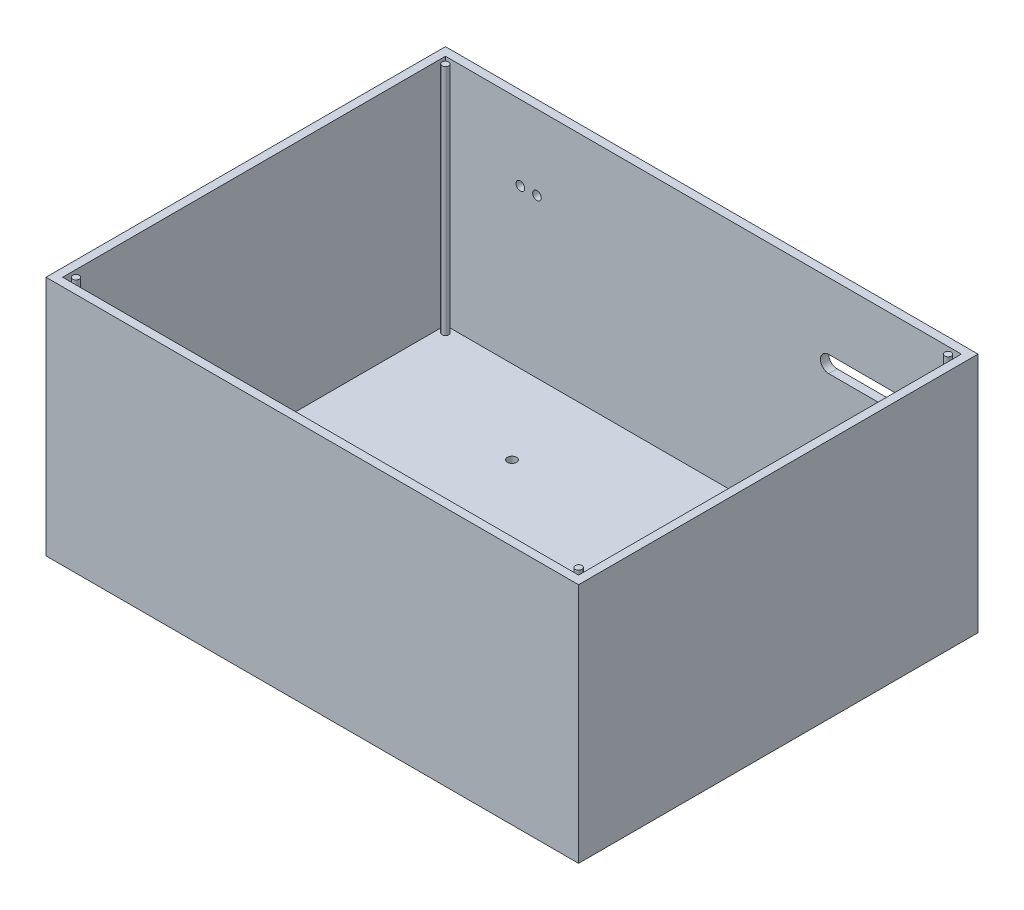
ISO-10303-21;
HEADER;
FILE_DESCRIPTION(('STEP AP214'),'2;1');
FILE_NAME('part.step','',(''),(''),'','','');
FILE_SCHEMA(('AUTOMOTIVE_DESIGN { 1 0 10303 214 1 1 1 1 }'));
ENDSEC;
DATA;
#1=APPLICATION_CONTEXT('core data for automotive mechanical design processes');
#2=APPLICATION_PROTOCOL_DEFINITION('international standard','automotive_design',2000,#1);
#3=PRODUCT_CONTEXT('',#1,'mechanical');
#4=PRODUCT('Part','Part','',(#3));
#5=PRODUCT_RELATED_PRODUCT_CATEGORY('part','',(#4));
#6=PRODUCT_DEFINITION_FORMATION('','',#4);
#7=PRODUCT_DEFINITION_CONTEXT('part definition',#1,'design');
#8=PRODUCT_DEFINITION('design','',#6,#7);
#9=PRODUCT_DEFINITION_SHAPE('','',#8);
#10=(LENGTH_UNIT() NAMED_UNIT(*) SI_UNIT(.MILLI.,.METRE.));
#11=(NAMED_UNIT(*) PLANE_ANGLE_UNIT() SI_UNIT($,.RADIAN.));
#12=(NAMED_UNIT(*) SI_UNIT($,.STERADIAN.) SOLID_ANGLE_UNIT());
#13=UNCERTAINTY_MEASURE_WITH_UNIT(LENGTH_MEASURE(1.E-05),#10,'distance_accuracy_value','');
#14=(GEOMETRIC_REPRESENTATION_CONTEXT(3) GLOBAL_UNCERTAINTY_ASSIGNED_CONTEXT((#13)) GLOBAL_UNIT_ASSIGNED_CONTEXT((#10,
#11,#12)) REPRESENTATION_CONTEXT('',''));
#15=CARTESIAN_POINT('',(0.,0.,0.));
#16=DIRECTION('',(0.,0.,1.));
#17=DIRECTION('',(1.,0.,0.));
#18=AXIS2_PLACEMENT_3D('',#15,#16,#17);
#19=CARTESIAN_POINT('',(0.,3.175,0.));
#20=DIRECTION('',(1.,0.,0.));
#21=DIRECTION('',(0.,0.,-1.));
#22=AXIS2_PLACEMENT_3D('',#19,#20,#21);
#23=PLANE('',#22);
#24=DIRECTION('',(0.,0.,1.));
#25=VECTOR('',#24,1.);
#26=CARTESIAN_POINT('',(0.,0.,0.));
#27=LINE('',#26,#25);
#28=CARTESIAN_POINT('',(0.,0.,-152.4));
#29=VERTEX_POINT('',#28);
#30=CARTESIAN_POINT('',(0.,0.,0.));
#31=VERTEX_POINT('',#30);
#32=EDGE_CURVE('E250',#29,#31,#27,.T.);
#33=ORIENTED_EDGE('',*,*,#32,.T.);
#34=DIRECTION('',(0.,-1.,0.));
#35=VECTOR('',#34,1.);
#36=CARTESIAN_POINT('',(0.,3.175,0.));
#37=LINE('',#36,#35);
#38=CARTESIAN_POINT('',(0.,92.075,0.));
#39=VERTEX_POINT('',#38);
#40=EDGE_CURVE('E268',#39,#31,#37,.T.);
#41=ORIENTED_EDGE('',*,*,#40,.F.);
#42=DIRECTION('',(0.,0.,1.));
#43=VECTOR('',#42,1.);
#44=CARTESIAN_POINT('',(0.,92.075,-152.4));
#45=LINE('',#44,#43);
#46=CARTESIAN_POINT('',(0.,92.075,-152.4));
#47=VERTEX_POINT('',#46);
#48=EDGE_CURVE('E244',#47,#39,#45,.T.);
#49=ORIENTED_EDGE('',*,*,#48,.F.);
#50=DIRECTION('',(0.,-1.,0.));
#51=VECTOR('',#50,1.);
#52=CARTESIAN_POINT('',(0.,3.175,-152.4));
#53=LINE('',#52,#51);
#54=EDGE_CURVE('E259',#47,#29,#53,.T.);
#55=ORIENTED_EDGE('',*,*,#54,.T.);
#56=EDGE_LOOP('',(#33,#41,#49,#55));
#57=FACE_BOUND('',#56,.T.);
#58=ADVANCED_FACE('F56',(#57),#23,.F.);
#59=CARTESIAN_POINT('',(0.,3.175,0.));
#60=DIRECTION('',(0.,0.,-1.));
#61=DIRECTION('',(-1.,0.,0.));
#62=AXIS2_PLACEMENT_3D('',#59,#60,#61);
#63=PLANE('',#62);
#64=DIRECTION('',(1.,0.,0.));
#65=VECTOR('',#64,1.);
#66=CARTESIAN_POINT('',(0.,0.,0.));
#67=LINE('',#66,#65);
#68=CARTESIAN_POINT('',(203.2,0.,0.));
#69=VERTEX_POINT('',#68);
#70=EDGE_CURVE('E253',#31,#69,#67,.T.);
#71=ORIENTED_EDGE('',*,*,#70,.T.);
#72=DIRECTION('',(0.,-1.,0.));
#73=VECTOR('',#72,1.);
#74=CARTESIAN_POINT('',(203.2,3.175,0.));
#75=LINE('',#74,#73);
#76=CARTESIAN_POINT('',(203.2,92.075,0.));
#77=VERTEX_POINT('',#76);
#78=EDGE_CURVE('E265',#77,#69,#75,.T.);
#79=ORIENTED_EDGE('',*,*,#78,.F.);
#80=DIRECTION('',(1.,0.,0.));
#81=VECTOR('',#80,1.);
#82=CARTESIAN_POINT('',(0.,92.075,0.));
#83=LINE('',#82,#81);
#84=EDGE_CURVE('E247',#39,#77,#83,.T.);
#85=ORIENTED_EDGE('',*,*,#84,.F.);
#86=ORIENTED_EDGE('',*,*,#40,.T.);
#87=EDGE_LOOP('',(#71,#79,#85,#86));
#88=FACE_BOUND('',#87,.T.);
#89=ADVANCED_FACE('F338',(#88),#63,.F.);
#90=CARTESIAN_POINT('',(203.2,3.175,0.));
#91=DIRECTION('',(-1.,0.,0.));
#92=DIRECTION('',(0.,0.,1.));
#93=AXIS2_PLACEMENT_3D('',#90,#91,#92);
#94=PLANE('',#93);
#95=DIRECTION('',(0.,0.,-1.));
#96=VECTOR('',#95,1.);
#97=CARTESIAN_POINT('',(203.2,0.,0.));
#98=LINE('',#97,#96);
#99=CARTESIAN_POINT('',(203.2,0.,-152.4));
#100=VERTEX_POINT('',#99);
#101=EDGE_CURVE('E255',#69,#100,#98,.T.);
#102=ORIENTED_EDGE('',*,*,#101,.T.);
#103=DIRECTION('',(0.,-1.,0.));
#104=VECTOR('',#103,1.);
#105=CARTESIAN_POINT('',(203.2,3.175,-152.4));
#106=LINE('',#105,#104);
#107=CARTESIAN_POINT('',(203.2,92.075,-152.4));
#108=VERTEX_POINT('',#107);
#109=EDGE_CURVE('E262',#108,#100,#106,.T.);
#110=ORIENTED_EDGE('',*,*,#109,.F.);
#111=DIRECTION('',(0.,0.,-1.));
#112=VECTOR('',#111,1.);
#113=CARTESIAN_POINT('',(203.2,92.075,0.));
#114=LINE('',#113,#112);
#115=EDGE_CURVE('E238',#77,#108,#114,.T.);
#116=ORIENTED_EDGE('',*,*,#115,.F.);
#117=ORIENTED_EDGE('',*,*,#78,.T.);
#118=EDGE_LOOP('',(#102,#110,#116,#117));
#119=FACE_BOUND('',#118,.T.);
#120=ADVANCED_FACE('F343',(#119),#94,.F.);
#121=CARTESIAN_POINT('',(0.,3.175,-152.4));
#122=DIRECTION('',(0.,0.,1.));
#123=DIRECTION('',(1.,0.,0.));
#124=AXIS2_PLACEMENT_3D('',#121,#122,#123);
#125=PLANE('',#124);
#126=CARTESIAN_POINT('',(149.422369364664,63.5,-152.4));
#127=DIRECTION('',(0.,0.,-1.));
#128=DIRECTION('',(-1.,0.,0.));
#129=AXIS2_PLACEMENT_3D('',#126,#127,#128);
#130=CIRCLE('',#129,3.17499999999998);
#131=CARTESIAN_POINT('',(149.422369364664,60.325,-152.4));
#132=VERTEX_POINT('',#131);
#133=CARTESIAN_POINT('',(149.422369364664,66.675,-152.4));
#134=VERTEX_POINT('',#133);
#135=EDGE_CURVE('E159',#132,#134,#130,.T.);
#136=ORIENTED_EDGE('',*,*,#135,.F.);
#137=DIRECTION('',(-1.,0.,0.));
#138=VECTOR('',#137,1.);
#139=CARTESIAN_POINT('',(174.625,60.325,-152.4));
#140=LINE('',#139,#138);
#141=CARTESIAN_POINT('',(174.625,60.325,-152.4));
#142=VERTEX_POINT('',#141);
#143=EDGE_CURVE('E178',#142,#132,#140,.T.);
#144=ORIENTED_EDGE('',*,*,#143,.F.);
#145=CARTESIAN_POINT('',(174.625,63.5,-152.4));
#146=DIRECTION('',(0.,0.,-1.));
#147=DIRECTION('',(-1.,0.,0.));
#148=AXIS2_PLACEMENT_3D('',#145,#146,#147);
#149=CIRCLE('',#148,3.17499999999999);
#150=CARTESIAN_POINT('',(174.625,66.675,-152.4));
#151=VERTEX_POINT('',#150);
#152=EDGE_CURVE('E176',#151,#142,#149,.T.);
#153=ORIENTED_EDGE('',*,*,#152,.F.);
#154=DIRECTION('',(1.,0.,0.));
#155=VECTOR('',#154,1.);
#156=CARTESIAN_POINT('',(174.625,66.675,-152.4));
#157=LINE('',#156,#155);
#158=EDGE_CURVE('E70',#134,#151,#157,.T.);
#159=ORIENTED_EDGE('',*,*,#158,.F.);
#160=EDGE_LOOP('',(#136,#144,#153,#159));
#161=FACE_BOUND('',#160,.T.);
#162=CARTESIAN_POINT('',(31.75,63.5,-152.4));
#163=DIRECTION('',(0.,0.,-1.));
#164=DIRECTION('',(-1.,0.,0.));
#165=AXIS2_PLACEMENT_3D('',#162,#163,#164);
#166=CIRCLE('',#165,1.651);
#167=CARTESIAN_POINT('',(30.099,63.5,-152.4));
#168=VERTEX_POINT('',#167);
#169=EDGE_CURVE('E194',#168,#168,#166,.T.);
#170=ORIENTED_EDGE('',*,*,#169,.F.);
#171=EDGE_LOOP('',(#170));
#172=FACE_BOUND('',#171,.T.);
#173=CARTESIAN_POINT('',(38.1,63.5,-152.4));
#174=DIRECTION('',(0.,0.,-1.));
#175=DIRECTION('',(-1.,0.,0.));
#176=AXIS2_PLACEMENT_3D('',#173,#174,#175);
#177=CIRCLE('',#176,1.651);
#178=CARTESIAN_POINT('',(36.449,63.5,-152.4));
#179=VERTEX_POINT('',#178);
#180=EDGE_CURVE('E187',#179,#179,#177,.T.);
#181=ORIENTED_EDGE('',*,*,#180,.F.);
#182=EDGE_LOOP('',(#181));
#183=FACE_BOUND('',#182,.T.);
#184=DIRECTION('',(-1.,0.,0.));
#185=VECTOR('',#184,1.);
#186=CARTESIAN_POINT('',(0.,0.,-152.4));
#187=LINE('',#186,#185);
#188=EDGE_CURVE('E257',#100,#29,#187,.T.);
#189=ORIENTED_EDGE('',*,*,#188,.T.);
#190=ORIENTED_EDGE('',*,*,#54,.F.);
#191=DIRECTION('',(-1.,0.,0.));
#192=VECTOR('',#191,1.);
#193=CARTESIAN_POINT('',(203.2,92.075,-152.4));
#194=LINE('',#193,#192);
#195=EDGE_CURVE('E241',#108,#47,#194,.T.);
#196=ORIENTED_EDGE('',*,*,#195,.F.);
#197=ORIENTED_EDGE('',*,*,#109,.T.);
#198=EDGE_LOOP('',(#189,#190,#196,#197));
#199=FACE_BOUND('',#198,.T.);
#200=ADVANCED_FACE('F357',(#161,#172,#183,#199),#125,.F.);
#201=CARTESIAN_POINT('',(0.,0.,0.));
#202=DIRECTION('',(0.,-1.,0.));
#203=DIRECTION('',(0.,0.,-1.));
#204=AXIS2_PLACEMENT_3D('',#201,#202,#203);
#205=PLANE('',#204);
#206=CARTESIAN_POINT('',(123.825,0.,-117.475));
#207=DIRECTION('',(0.,1.,0.));
#208=DIRECTION('',(0.,0.,1.));
#209=AXIS2_PLACEMENT_3D('',#206,#207,#208);
#210=CIRCLE('',#209,1.71449999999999);
#211=CARTESIAN_POINT('',(123.825,0.,-115.7605));
#212=VERTEX_POINT('',#211);
#213=EDGE_CURVE('E198',#212,#212,#210,.T.);
#214=ORIENTED_EDGE('',*,*,#213,.T.);
#215=EDGE_LOOP('',(#214));
#216=FACE_BOUND('',#215,.T.);
#217=CARTESIAN_POINT('',(60.325,0.,-47.625));
#218=DIRECTION('',(0.,1.,0.));
#219=DIRECTION('',(0.,0.,1.));
#220=AXIS2_PLACEMENT_3D('',#217,#218,#219);
#221=CIRCLE('',#220,1.7145);
#222=CARTESIAN_POINT('',(60.325,0.,-45.9105));
#223=VERTEX_POINT('',#222);
#224=EDGE_CURVE('E197',#223,#223,#221,.T.);
#225=ORIENTED_EDGE('',*,*,#224,.T.);
#226=EDGE_LOOP('',(#225));
#227=FACE_BOUND('',#226,.T.);
#228=CARTESIAN_POINT('',(123.825,0.,-47.625));
#229=DIRECTION('',(0.,1.,0.));
#230=DIRECTION('',(0.,0.,1.));
#231=AXIS2_PLACEMENT_3D('',#228,#229,#230);
#232=CIRCLE('',#231,1.71449999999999);
#233=CARTESIAN_POINT('',(123.825,0.,-45.9105));
#234=VERTEX_POINT('',#233);
#235=EDGE_CURVE('E190',#234,#234,#232,.T.);
#236=ORIENTED_EDGE('',*,*,#235,.T.);
#237=EDGE_LOOP('',(#236));
#238=FACE_BOUND('',#237,.T.);
#239=CARTESIAN_POINT('',(60.325,0.,-117.475));
#240=DIRECTION('',(0.,1.,0.));
#241=DIRECTION('',(0.,0.,1.));
#242=AXIS2_PLACEMENT_3D('',#239,#240,#241);
#243=CIRCLE('',#242,1.7145);
#244=CARTESIAN_POINT('',(60.325,0.,-115.7605));
#245=VERTEX_POINT('',#244);
#246=EDGE_CURVE('E201',#245,#245,#243,.T.);
#247=ORIENTED_EDGE('',*,*,#246,.T.);
#248=EDGE_LOOP('',(#247));
#249=FACE_BOUND('',#248,.T.);
#250=ORIENTED_EDGE('',*,*,#32,.F.);
#251=ORIENTED_EDGE('',*,*,#188,.F.);
#252=ORIENTED_EDGE('',*,*,#101,.F.);
#253=ORIENTED_EDGE('',*,*,#70,.F.);
#254=EDGE_LOOP('',(#250,#251,#252,#253));
#255=FACE_BOUND('',#254,.T.);
#256=ADVANCED_FACE('F349',(#216,#227,#238,#249,#255),#205,.T.);
#257=CARTESIAN_POINT('',(0.,92.075,0.));
#258=DIRECTION('',(0.,1.,0.));
#259=DIRECTION('',(0.,0.,1.));
#260=AXIS2_PLACEMENT_3D('',#257,#258,#259);
#261=PLANE('',#260);
#262=ORIENTED_EDGE('',*,*,#115,.T.);
#263=ORIENTED_EDGE('',*,*,#195,.T.);
#264=ORIENTED_EDGE('',*,*,#48,.T.);
#265=ORIENTED_EDGE('',*,*,#84,.T.);
#266=EDGE_LOOP('',(#262,#263,#264,#265));
#267=FACE_BOUND('',#266,.T.);
#268=DIRECTION('',(1.,0.,0.));
#269=VECTOR('',#268,1.);
#270=CARTESIAN_POINT('',(3.175,92.075,-3.175));
#271=LINE('',#270,#269);
#272=CARTESIAN_POINT('',(3.175,92.075,-3.175));
#273=VERTEX_POINT('',#272);
#274=CARTESIAN_POINT('',(200.025,92.075,-3.175));
#275=VERTEX_POINT('',#274);
#276=EDGE_CURVE('E209',#273,#275,#271,.T.);
#277=ORIENTED_EDGE('',*,*,#276,.F.);
#278=DIRECTION('',(0.,0.,1.));
#279=VECTOR('',#278,1.);
#280=CARTESIAN_POINT('',(3.175,92.075,-149.225));
#281=LINE('',#280,#279);
#282=CARTESIAN_POINT('',(3.175,92.075,-149.225));
#283=VERTEX_POINT('',#282);
#284=EDGE_CURVE('E207',#283,#273,#281,.T.);
#285=ORIENTED_EDGE('',*,*,#284,.F.);
#286=DIRECTION('',(-1.,0.,0.));
#287=VECTOR('',#286,1.);
#288=CARTESIAN_POINT('',(200.025,92.075,-149.225));
#289=LINE('',#288,#287);
#290=CARTESIAN_POINT('',(200.025,92.075,-149.225));
#291=VERTEX_POINT('',#290);
#292=EDGE_CURVE('E215',#291,#283,#289,.T.);
#293=ORIENTED_EDGE('',*,*,#292,.F.);
#294=DIRECTION('',(0.,0.,-1.));
#295=VECTOR('',#294,1.);
#296=CARTESIAN_POINT('',(200.025,92.075,-3.175));
#297=LINE('',#296,#295);
#298=EDGE_CURVE('E212',#275,#291,#297,.T.);
#299=ORIENTED_EDGE('',*,*,#298,.F.);
#300=EDGE_LOOP('',(#277,#285,#293,#299));
#301=FACE_BOUND('',#300,.T.);
#302=ADVANCED_FACE('F326',(#267,#301),#261,.T.);
#303=CARTESIAN_POINT('',(3.175,92.075,-149.225));
#304=DIRECTION('',(1.,0.,0.));
#305=DIRECTION('',(0.,0.,-1.));
#306=AXIS2_PLACEMENT_3D('',#303,#304,#305);
#307=PLANE('',#306);
#308=DIRECTION('',(0.,0.,1.));
#309=VECTOR('',#308,1.);
#310=CARTESIAN_POINT('',(3.175,3.175,-149.225));
#311=LINE('',#310,#309);
#312=CARTESIAN_POINT('',(3.175,3.175,-149.225));
#313=VERTEX_POINT('',#312);
#314=CARTESIAN_POINT('',(3.175,3.175,-3.175));
#315=VERTEX_POINT('',#314);
#316=EDGE_CURVE('E218',#313,#315,#311,.T.);
#317=ORIENTED_EDGE('',*,*,#316,.F.);
#318=DIRECTION('',(0.,-1.,0.));
#319=VECTOR('',#318,1.);
#320=CARTESIAN_POINT('',(3.175,92.075,-149.225));
#321=LINE('',#320,#319);
#322=EDGE_CURVE('E217',#283,#313,#321,.T.);
#323=ORIENTED_EDGE('',*,*,#322,.F.);
#324=ORIENTED_EDGE('',*,*,#284,.T.);
#325=DIRECTION('',(0.,-1.,0.));
#326=VECTOR('',#325,1.);
#327=CARTESIAN_POINT('',(3.175,92.075,-3.175));
#328=LINE('',#327,#326);
#329=EDGE_CURVE('E235',#273,#315,#328,.T.);
#330=ORIENTED_EDGE('',*,*,#329,.T.);
#331=EDGE_LOOP('',(#317,#323,#324,#330));
#332=FACE_BOUND('',#331,.T.);
#333=ADVANCED_FACE('F318',(#332),#307,.T.);
#334=CARTESIAN_POINT('',(3.175,92.075,-3.175));
#335=DIRECTION('',(0.,0.,-1.));
#336=DIRECTION('',(-1.,0.,0.));
#337=AXIS2_PLACEMENT_3D('',#334,#335,#336);
#338=PLANE('',#337);
#339=DIRECTION('',(1.,0.,0.));
#340=VECTOR('',#339,1.);
#341=CARTESIAN_POINT('',(3.175,3.175,-3.175));
#342=LINE('',#341,#340);
#343=CARTESIAN_POINT('',(200.025,3.175,-3.175));
#344=VERTEX_POINT('',#343);
#345=EDGE_CURVE('E221',#315,#344,#342,.T.);
#346=ORIENTED_EDGE('',*,*,#345,.F.);
#347=ORIENTED_EDGE('',*,*,#329,.F.);
#348=ORIENTED_EDGE('',*,*,#276,.T.);
#349=DIRECTION('',(0.,-1.,0.));
#350=VECTOR('',#349,1.);
#351=CARTESIAN_POINT('',(200.025,92.075,-3.175));
#352=LINE('',#351,#350);
#353=EDGE_CURVE('E233',#275,#344,#352,.T.);
#354=ORIENTED_EDGE('',*,*,#353,.T.);
#355=EDGE_LOOP('',(#346,#347,#348,#354));
#356=FACE_BOUND('',#355,.T.);
#357=ADVANCED_FACE('F322',(#356),#338,.T.);
#358=CARTESIAN_POINT('',(200.025,92.075,-3.175));
#359=DIRECTION('',(-1.,0.,0.));
#360=DIRECTION('',(0.,0.,1.));
#361=AXIS2_PLACEMENT_3D('',#358,#359,#360);
#362=PLANE('',#361);
#363=DIRECTION('',(0.,0.,-1.));
#364=VECTOR('',#363,1.);
#365=CARTESIAN_POINT('',(200.025,3.175,-3.175));
#366=LINE('',#365,#364);
#367=CARTESIAN_POINT('',(200.025,3.175,-149.225));
#368=VERTEX_POINT('',#367);
#369=EDGE_CURVE('E225',#344,#368,#366,.T.);
#370=ORIENTED_EDGE('',*,*,#369,.F.);
#371=ORIENTED_EDGE('',*,*,#353,.F.);
#372=ORIENTED_EDGE('',*,*,#298,.T.);
#373=DIRECTION('',(0.,-1.,0.));
#374=VECTOR('',#373,1.);
#375=CARTESIAN_POINT('',(200.025,92.075,-149.225));
#376=LINE('',#375,#374);
#377=EDGE_CURVE('E231',#291,#368,#376,.T.);
#378=ORIENTED_EDGE('',*,*,#377,.T.);
#379=EDGE_LOOP('',(#370,#371,#372,#378));
#380=FACE_BOUND('',#379,.T.);
#381=ADVANCED_FACE('F328',(#380),#362,.T.);
#382=CARTESIAN_POINT('',(200.025,92.075,-149.225));
#383=DIRECTION('',(0.,0.,1.));
#384=DIRECTION('',(1.,0.,0.));
#385=AXIS2_PLACEMENT_3D('',#382,#383,#384);
#386=PLANE('',#385);
#387=DIRECTION('',(-1.,0.,0.));
#388=VECTOR('',#387,1.);
#389=CARTESIAN_POINT('',(174.625,60.325,-149.225));
#390=LINE('',#389,#388);
#391=CARTESIAN_POINT('',(174.625,60.325,-149.225));
#392=VERTEX_POINT('',#391);
#393=CARTESIAN_POINT('',(149.422369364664,60.325,-149.225));
#394=VERTEX_POINT('',#393);
#395=EDGE_CURVE('E165',#392,#394,#390,.T.);
#396=ORIENTED_EDGE('',*,*,#395,.T.);
#397=CARTESIAN_POINT('',(149.422369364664,63.5,-149.225));
#398=DIRECTION('',(0.,0.,1.));
#399=DIRECTION('',(1.,0.,0.));
#400=AXIS2_PLACEMENT_3D('',#397,#398,#399);
#401=CIRCLE('',#400,3.17499999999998);
#402=CARTESIAN_POINT('',(149.422369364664,66.675,-149.225));
#403=VERTEX_POINT('',#402);
#404=EDGE_CURVE('E153',#394,#403,#401,.F.);
#405=ORIENTED_EDGE('',*,*,#404,.T.);
#406=DIRECTION('',(1.,0.,0.));
#407=VECTOR('',#406,1.);
#408=CARTESIAN_POINT('',(174.625,66.675,-149.225));
#409=LINE('',#408,#407);
#410=CARTESIAN_POINT('',(174.625,66.675,-149.225));
#411=VERTEX_POINT('',#410);
#412=EDGE_CURVE('E143',#403,#411,#409,.T.);
#413=ORIENTED_EDGE('',*,*,#412,.T.);
#414=CARTESIAN_POINT('',(174.625,63.5,-149.225));
#415=DIRECTION('',(0.,0.,1.));
#416=DIRECTION('',(1.,0.,0.));
#417=AXIS2_PLACEMENT_3D('',#414,#415,#416);
#418=CIRCLE('',#417,3.17499999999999);
#419=EDGE_CURVE('E152',#411,#392,#418,.F.);
#420=ORIENTED_EDGE('',*,*,#419,.T.);
#421=EDGE_LOOP('',(#396,#405,#413,#420));
#422=FACE_BOUND('',#421,.T.);
#423=CARTESIAN_POINT('',(31.75,63.5,-149.225));
#424=DIRECTION('',(0.,0.,1.));
#425=DIRECTION('',(1.,0.,0.));
#426=AXIS2_PLACEMENT_3D('',#423,#424,#425);
#427=CIRCLE('',#426,1.651);
#428=CARTESIAN_POINT('',(33.401,63.5,-149.225));
#429=VERTEX_POINT('',#428);
#430=EDGE_CURVE('E172',#429,#429,#427,.F.);
#431=ORIENTED_EDGE('',*,*,#430,.T.);
#432=EDGE_LOOP('',(#431));
#433=FACE_BOUND('',#432,.T.);
#434=CARTESIAN_POINT('',(38.1,63.5,-149.225));
#435=DIRECTION('',(0.,0.,1.));
#436=DIRECTION('',(1.,0.,0.));
#437=AXIS2_PLACEMENT_3D('',#434,#435,#436);
#438=CIRCLE('',#437,1.651);
#439=CARTESIAN_POINT('',(39.751,63.5,-149.225));
#440=VERTEX_POINT('',#439);
#441=EDGE_CURVE('E191',#440,#440,#438,.F.);
#442=ORIENTED_EDGE('',*,*,#441,.T.);
#443=EDGE_LOOP('',(#442));
#444=FACE_BOUND('',#443,.T.);
#445=DIRECTION('',(-1.,0.,0.));
#446=VECTOR('',#445,1.);
#447=CARTESIAN_POINT('',(200.025,3.175,-149.225));
#448=LINE('',#447,#446);
#449=EDGE_CURVE('E210',#368,#313,#448,.T.);
#450=ORIENTED_EDGE('',*,*,#449,.F.);
#451=ORIENTED_EDGE('',*,*,#377,.F.);
#452=ORIENTED_EDGE('',*,*,#292,.T.);
#453=ORIENTED_EDGE('',*,*,#322,.T.);
#454=EDGE_LOOP('',(#450,#451,#452,#453));
#455=FACE_BOUND('',#454,.T.);
#456=ADVANCED_FACE('F163',(#422,#433,#444,#455),#386,.T.);
#457=CARTESIAN_POINT('',(0.,3.175,0.));
#458=DIRECTION('',(0.,-1.,0.));
#459=DIRECTION('',(0.,0.,-1.));
#460=AXIS2_PLACEMENT_3D('',#457,#458,#459);
#461=PLANE('',#460);
#462=CARTESIAN_POINT('',(197.485,3.175,-146.685));
#463=DIRECTION('',(0.,-1.,0.));
#464=DIRECTION('',(0.,0.,-1.));
#465=AXIS2_PLACEMENT_3D('',#462,#463,#464);
#466=CIRCLE('',#465,1.27000000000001);
#467=CARTESIAN_POINT('',(197.485,3.175,-147.955));
#468=VERTEX_POINT('',#467);
#469=EDGE_CURVE('E12',#468,#468,#466,.F.);
#470=ORIENTED_EDGE('',*,*,#469,.F.);
#471=EDGE_LOOP('',(#470));
#472=FACE_BOUND('',#471,.T.);
#473=CARTESIAN_POINT('',(197.485,3.175,-5.715));
#474=DIRECTION('',(0.,-1.,0.));
#475=DIRECTION('',(0.,0.,-1.));
#476=AXIS2_PLACEMENT_3D('',#473,#474,#475);
#477=CIRCLE('',#476,1.27);
#478=CARTESIAN_POINT('',(197.485,3.175,-6.985));
#479=VERTEX_POINT('',#478);
#480=EDGE_CURVE('E63',#479,#479,#477,.F.);
#481=ORIENTED_EDGE('',*,*,#480,.F.);
#482=EDGE_LOOP('',(#481));
#483=FACE_BOUND('',#482,.T.);
#484=CARTESIAN_POINT('',(5.715,3.175,-146.685));
#485=DIRECTION('',(0.,-1.,0.));
#486=DIRECTION('',(0.,0.,-1.));
#487=AXIS2_PLACEMENT_3D('',#484,#485,#486);
#488=CIRCLE('',#487,1.27);
#489=CARTESIAN_POINT('',(5.715,3.175,-147.955));
#490=VERTEX_POINT('',#489);
#491=EDGE_CURVE('E284',#490,#490,#488,.F.);
#492=ORIENTED_EDGE('',*,*,#491,.F.);
#493=EDGE_LOOP('',(#492));
#494=FACE_BOUND('',#493,.T.);
#495=CARTESIAN_POINT('',(5.715,3.175,-5.715));
#496=DIRECTION('',(0.,-1.,0.));
#497=DIRECTION('',(0.,0.,-1.));
#498=AXIS2_PLACEMENT_3D('',#495,#496,#497);
#499=CIRCLE('',#498,1.27);
#500=CARTESIAN_POINT('',(5.715,3.175,-6.985));
#501=VERTEX_POINT('',#500);
#502=EDGE_CURVE('E271',#501,#501,#499,.F.);
#503=ORIENTED_EDGE('',*,*,#502,.F.);
#504=EDGE_LOOP('',(#503));
#505=FACE_BOUND('',#504,.T.);
#506=CARTESIAN_POINT('',(123.825,3.175,-117.475));
#507=DIRECTION('',(0.,-1.,0.));
#508=DIRECTION('',(0.,0.,-1.));
#509=AXIS2_PLACEMENT_3D('',#506,#507,#508);
#510=CIRCLE('',#509,1.71449999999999);
#511=CARTESIAN_POINT('',(123.825,3.175,-119.1895));
#512=VERTEX_POINT('',#511);
#513=EDGE_CURVE('E222',#512,#512,#510,.T.);
#514=ORIENTED_EDGE('',*,*,#513,.T.);
#515=EDGE_LOOP('',(#514));
#516=FACE_BOUND('',#515,.T.);
#517=CARTESIAN_POINT('',(60.325,3.175,-47.625));
#518=DIRECTION('',(0.,-1.,0.));
#519=DIRECTION('',(0.,0.,-1.));
#520=AXIS2_PLACEMENT_3D('',#517,#518,#519);
#521=CIRCLE('',#520,1.7145);
#522=CARTESIAN_POINT('',(60.325,3.175,-49.3395));
#523=VERTEX_POINT('',#522);
#524=EDGE_CURVE('E277',#523,#523,#521,.T.);
#525=ORIENTED_EDGE('',*,*,#524,.T.);
#526=EDGE_LOOP('',(#525));
#527=FACE_BOUND('',#526,.T.);
#528=CARTESIAN_POINT('',(123.825,3.175,-47.625));
#529=DIRECTION('',(0.,-1.,0.));
#530=DIRECTION('',(0.,0.,-1.));
#531=AXIS2_PLACEMENT_3D('',#528,#529,#530);
#532=CIRCLE('',#531,1.71449999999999);
#533=CARTESIAN_POINT('',(123.825,3.175,-49.3395));
#534=VERTEX_POINT('',#533);
#535=EDGE_CURVE('E274',#534,#534,#532,.T.);
#536=ORIENTED_EDGE('',*,*,#535,.T.);
#537=EDGE_LOOP('',(#536));
#538=FACE_BOUND('',#537,.T.);
#539=CARTESIAN_POINT('',(60.325,3.175,-117.475));
#540=DIRECTION('',(0.,-1.,0.));
#541=DIRECTION('',(0.,0.,-1.));
#542=AXIS2_PLACEMENT_3D('',#539,#540,#541);
#543=CIRCLE('',#542,1.7145);
#544=CARTESIAN_POINT('',(60.325,3.175,-119.1895));
#545=VERTEX_POINT('',#544);
#546=EDGE_CURVE('E206',#545,#545,#543,.T.);
#547=ORIENTED_EDGE('',*,*,#546,.T.);
#548=EDGE_LOOP('',(#547));
#549=FACE_BOUND('',#548,.T.);
#550=ORIENTED_EDGE('',*,*,#449,.T.);
#551=ORIENTED_EDGE('',*,*,#316,.T.);
#552=ORIENTED_EDGE('',*,*,#345,.T.);
#553=ORIENTED_EDGE('',*,*,#369,.T.);
#554=EDGE_LOOP('',(#550,#551,#552,#553));
#555=FACE_BOUND('',#554,.T.);
#556=ADVANCED_FACE('F292',(#472,#483,#494,#505,#516,#527,#538,#549,#555),#461,.F.);
#557=CARTESIAN_POINT('',(60.325,0.,-117.475));
#558=DIRECTION('',(0.,1.,0.));
#559=DIRECTION('',(0.,0.,1.));
#560=AXIS2_PLACEMENT_3D('',#557,#558,#559);
#561=CYLINDRICAL_SURFACE('',#560,1.7145);
#562=ORIENTED_EDGE('',*,*,#246,.F.);
#563=EDGE_LOOP('',(#562));
#564=FACE_BOUND('',#563,.T.);
#565=ORIENTED_EDGE('',*,*,#546,.F.);
#566=EDGE_LOOP('',(#565));
#567=FACE_BOUND('',#566,.T.);
#568=ADVANCED_FACE('F295',(#564,#567),#561,.F.);
#569=CARTESIAN_POINT('',(123.825,0.,-47.625));
#570=DIRECTION('',(0.,1.,0.));
#571=DIRECTION('',(0.,0.,1.));
#572=AXIS2_PLACEMENT_3D('',#569,#570,#571);
#573=CYLINDRICAL_SURFACE('',#572,1.71449999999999);
#574=ORIENTED_EDGE('',*,*,#235,.F.);
#575=EDGE_LOOP('',(#574));
#576=FACE_BOUND('',#575,.T.);
#577=ORIENTED_EDGE('',*,*,#535,.F.);
#578=EDGE_LOOP('',(#577));
#579=FACE_BOUND('',#578,.T.);
#580=ADVANCED_FACE('F403',(#576,#579),#573,.F.);
#581=CARTESIAN_POINT('',(60.325,0.,-47.625));
#582=DIRECTION('',(0.,1.,0.));
#583=DIRECTION('',(0.,0.,1.));
#584=AXIS2_PLACEMENT_3D('',#581,#582,#583);
#585=CYLINDRICAL_SURFACE('',#584,1.7145);
#586=ORIENTED_EDGE('',*,*,#224,.F.);
#587=EDGE_LOOP('',(#586));
#588=FACE_BOUND('',#587,.T.);
#589=ORIENTED_EDGE('',*,*,#524,.F.);
#590=EDGE_LOOP('',(#589));
#591=FACE_BOUND('',#590,.T.);
#592=ADVANCED_FACE('F413',(#588,#591),#585,.F.);
#593=CARTESIAN_POINT('',(123.825,0.,-117.475));
#594=DIRECTION('',(0.,1.,0.));
#595=DIRECTION('',(0.,0.,1.));
#596=AXIS2_PLACEMENT_3D('',#593,#594,#595);
#597=CYLINDRICAL_SURFACE('',#596,1.71449999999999);
#598=ORIENTED_EDGE('',*,*,#213,.F.);
#599=EDGE_LOOP('',(#598));
#600=FACE_BOUND('',#599,.T.);
#601=ORIENTED_EDGE('',*,*,#513,.F.);
#602=EDGE_LOOP('',(#601));
#603=FACE_BOUND('',#602,.T.);
#604=ADVANCED_FACE('F423',(#600,#603),#597,.F.);
#605=CARTESIAN_POINT('',(38.1,63.5,0.001000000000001));
#606=DIRECTION('',(0.,0.,-1.));
#607=DIRECTION('',(-1.,0.,0.));
#608=AXIS2_PLACEMENT_3D('',#605,#606,#607);
#609=CYLINDRICAL_SURFACE('',#608,1.651);
#610=ORIENTED_EDGE('',*,*,#441,.F.);
#611=EDGE_LOOP('',(#610));
#612=FACE_BOUND('',#611,.T.);
#613=ORIENTED_EDGE('',*,*,#180,.T.);
#614=EDGE_LOOP('',(#613));
#615=FACE_BOUND('',#614,.T.);
#616=ADVANCED_FACE('F432',(#612,#615),#609,.F.);
#617=CARTESIAN_POINT('',(31.75,63.5,0.001000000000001));
#618=DIRECTION('',(0.,0.,-1.));
#619=DIRECTION('',(-1.,0.,0.));
#620=AXIS2_PLACEMENT_3D('',#617,#618,#619);
#621=CYLINDRICAL_SURFACE('',#620,1.651);
#622=ORIENTED_EDGE('',*,*,#430,.F.);
#623=EDGE_LOOP('',(#622));
#624=FACE_BOUND('',#623,.T.);
#625=ORIENTED_EDGE('',*,*,#169,.T.);
#626=EDGE_LOOP('',(#625));
#627=FACE_BOUND('',#626,.T.);
#628=ADVANCED_FACE('F455',(#624,#627),#621,.F.);
#629=CARTESIAN_POINT('',(174.625,60.325,0.001000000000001));
#630=DIRECTION('',(0.,-1.,0.));
#631=DIRECTION('',(1.,0.,0.));
#632=AXIS2_PLACEMENT_3D('',#629,#630,#631);
#633=PLANE('',#632);
#634=DIRECTION('',(0.,0.,-1.));
#635=VECTOR('',#634,1.);
#636=CARTESIAN_POINT('',(174.625,60.325,0.001000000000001));
#637=LINE('',#636,#635);
#638=EDGE_CURVE('E78',#392,#142,#637,.T.);
#639=ORIENTED_EDGE('',*,*,#638,.T.);
#640=ORIENTED_EDGE('',*,*,#143,.T.);
#641=DIRECTION('',(0.,0.,-1.));
#642=VECTOR('',#641,1.);
#643=CARTESIAN_POINT('',(149.422369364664,60.325,0.001000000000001));
#644=LINE('',#643,#642);
#645=EDGE_CURVE('E160',#394,#132,#644,.T.);
#646=ORIENTED_EDGE('',*,*,#645,.F.);
#647=ORIENTED_EDGE('',*,*,#395,.F.);
#648=EDGE_LOOP('',(#639,#640,#646,#647));
#649=FACE_BOUND('',#648,.T.);
#650=ADVANCED_FACE('F465',(#649),#633,.F.);
#651=CARTESIAN_POINT('',(149.422369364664,63.5,0.001000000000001));
#652=DIRECTION('',(0.,0.,-1.));
#653=DIRECTION('',(-1.,0.,0.));
#654=AXIS2_PLACEMENT_3D('',#651,#652,#653);
#655=CYLINDRICAL_SURFACE('',#654,3.17499999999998);
#656=ORIENTED_EDGE('',*,*,#645,.T.);
#657=ORIENTED_EDGE('',*,*,#135,.T.);
#658=DIRECTION('',(0.,0.,-1.));
#659=VECTOR('',#658,1.);
#660=CARTESIAN_POINT('',(149.422369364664,66.675,0.001000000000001));
#661=LINE('',#660,#659);
#662=EDGE_CURVE('E146',#403,#134,#661,.T.);
#663=ORIENTED_EDGE('',*,*,#662,.F.);
#664=ORIENTED_EDGE('',*,*,#404,.F.);
#665=EDGE_LOOP('',(#656,#657,#663,#664));
#666=FACE_BOUND('',#665,.T.);
#667=ADVANCED_FACE('F156',(#666),#655,.F.);
#668=CARTESIAN_POINT('',(174.625,66.675,0.001000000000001));
#669=DIRECTION('',(0.,1.,0.));
#670=DIRECTION('',(0.,0.,1.));
#671=AXIS2_PLACEMENT_3D('',#668,#669,#670);
#672=PLANE('',#671);
#673=ORIENTED_EDGE('',*,*,#662,.T.);
#674=ORIENTED_EDGE('',*,*,#158,.T.);
#675=DIRECTION('',(0.,0.,-1.));
#676=VECTOR('',#675,1.);
#677=CARTESIAN_POINT('',(174.625,66.675,0.001000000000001));
#678=LINE('',#677,#676);
#679=EDGE_CURVE('E148',#411,#151,#678,.T.);
#680=ORIENTED_EDGE('',*,*,#679,.F.);
#681=ORIENTED_EDGE('',*,*,#412,.F.);
#682=EDGE_LOOP('',(#673,#674,#680,#681));
#683=FACE_BOUND('',#682,.T.);
#684=ADVANCED_FACE('F145',(#683),#672,.F.);
#685=CARTESIAN_POINT('',(174.625,63.5,0.001000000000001));
#686=DIRECTION('',(0.,0.,-1.));
#687=DIRECTION('',(-1.,0.,0.));
#688=AXIS2_PLACEMENT_3D('',#685,#686,#687);
#689=CYLINDRICAL_SURFACE('',#688,3.17499999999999);
#690=ORIENTED_EDGE('',*,*,#679,.T.);
#691=ORIENTED_EDGE('',*,*,#152,.T.);
#692=ORIENTED_EDGE('',*,*,#638,.F.);
#693=ORIENTED_EDGE('',*,*,#419,.F.);
#694=EDGE_LOOP('',(#690,#691,#692,#693));
#695=FACE_BOUND('',#694,.T.);
#696=ADVANCED_FACE('F492',(#695),#689,.F.);
#697=CARTESIAN_POINT('',(5.715,95.6671024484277,-5.715));
#698=DIRECTION('',(0.,-1.,0.));
#699=DIRECTION('',(0.,0.,-1.));
#700=AXIS2_PLACEMENT_3D('',#697,#698,#699);
#701=CYLINDRICAL_SURFACE('',#700,1.27);
#702=CARTESIAN_POINT('',(5.715,92.075,-5.715));
#703=DIRECTION('',(0.,1.,0.));
#704=DIRECTION('',(0.,0.,1.));
#705=AXIS2_PLACEMENT_3D('',#702,#703,#704);
#706=CIRCLE('',#705,1.27);
#707=CARTESIAN_POINT('',(5.715,92.075,-6.985));
#708=VERTEX_POINT('',#707);
#709=EDGE_CURVE('E166',#708,#708,#706,.T.);
#710=CARTESIAN_POINT('',(5.715,3.175,-6.985));
#711=CARTESIAN_POINT('',(5.715,4.10104166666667,-6.985));
#712=CARTESIAN_POINT('',(5.715,5.02708333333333,-6.985));
#713=CARTESIAN_POINT('',(5.715,6.87916666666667,-6.985));
#714=CARTESIAN_POINT('',(5.715,7.80520833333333,-6.985));
#715=CARTESIAN_POINT('',(5.715,9.65729166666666,-6.985));
#716=CARTESIAN_POINT('',(5.715,10.5833333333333,-6.985));
#717=CARTESIAN_POINT('',(5.715,12.4354166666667,-6.985));
#718=CARTESIAN_POINT('',(5.715,13.3614583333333,-6.985));
#719=CARTESIAN_POINT('',(5.715,15.2135416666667,-6.985));
#720=CARTESIAN_POINT('',(5.715,16.1395833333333,-6.985));
#721=CARTESIAN_POINT('',(5.715,17.9916666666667,-6.985));
#722=CARTESIAN_POINT('',(5.715,18.9177083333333,-6.985));
#723=CARTESIAN_POINT('',(5.715,20.7697916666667,-6.985));
#724=CARTESIAN_POINT('',(5.715,21.6958333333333,-6.985));
#725=CARTESIAN_POINT('',(5.715,23.5479166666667,-6.985));
#726=CARTESIAN_POINT('',(5.715,24.4739583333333,-6.985));
#727=CARTESIAN_POINT('',(5.715,26.3260416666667,-6.985));
#728=CARTESIAN_POINT('',(5.715,27.2520833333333,-6.985));
#729=CARTESIAN_POINT('',(5.715,29.1041666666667,-6.985));
#730=CARTESIAN_POINT('',(5.715,30.0302083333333,-6.985));
#731=CARTESIAN_POINT('',(5.715,31.8822916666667,-6.985));
#732=CARTESIAN_POINT('',(5.715,32.8083333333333,-6.985));
#733=CARTESIAN_POINT('',(5.715,34.6604166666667,-6.985));
#734=CARTESIAN_POINT('',(5.715,35.5864583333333,-6.985));
#735=CARTESIAN_POINT('',(5.715,37.4385416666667,-6.985));
#736=CARTESIAN_POINT('',(5.715,38.3645833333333,-6.985));
#737=CARTESIAN_POINT('',(5.715,40.2166666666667,-6.985));
#738=CARTESIAN_POINT('',(5.715,41.1427083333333,-6.985));
#739=CARTESIAN_POINT('',(5.715,42.9947916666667,-6.985));
#740=CARTESIAN_POINT('',(5.715,43.9208333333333,-6.985));
#741=CARTESIAN_POINT('',(5.715,45.7729166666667,-6.985));
#742=CARTESIAN_POINT('',(5.715,46.6989583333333,-6.985));
#743=CARTESIAN_POINT('',(5.715,48.5510416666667,-6.985));
#744=CARTESIAN_POINT('',(5.715,49.4770833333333,-6.985));
#745=CARTESIAN_POINT('',(5.715,51.3291666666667,-6.985));
#746=CARTESIAN_POINT('',(5.715,52.2552083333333,-6.985));
#747=CARTESIAN_POINT('',(5.715,54.1072916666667,-6.985));
#748=CARTESIAN_POINT('',(5.715,55.0333333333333,-6.985));
#749=CARTESIAN_POINT('',(5.715,56.8854166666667,-6.985));
#750=CARTESIAN_POINT('',(5.715,57.8114583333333,-6.985));
#751=CARTESIAN_POINT('',(5.715,59.6635416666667,-6.985));
#752=CARTESIAN_POINT('',(5.715,60.5895833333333,-6.985));
#753=CARTESIAN_POINT('',(5.715,62.4416666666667,-6.985));
#754=CARTESIAN_POINT('',(5.715,63.3677083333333,-6.985));
#755=CARTESIAN_POINT('',(5.715,65.2197916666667,-6.985));
#756=CARTESIAN_POINT('',(5.715,66.1458333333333,-6.985));
#757=CARTESIAN_POINT('',(5.715,67.9979166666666,-6.985));
#758=CARTESIAN_POINT('',(5.715,68.9239583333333,-6.985));
#759=CARTESIAN_POINT('',(5.715,70.7760416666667,-6.985));
#760=CARTESIAN_POINT('',(5.715,71.7020833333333,-6.985));
#761=CARTESIAN_POINT('',(5.715,73.5541666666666,-6.985));
#762=CARTESIAN_POINT('',(5.715,74.4802083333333,-6.985));
#763=CARTESIAN_POINT('',(5.715,76.3322916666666,-6.985));
#764=CARTESIAN_POINT('',(5.715,77.2583333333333,-6.985));
#765=CARTESIAN_POINT('',(5.715,79.1104166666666,-6.985));
#766=CARTESIAN_POINT('',(5.715,80.0364583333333,-6.985));
#767=CARTESIAN_POINT('',(5.715,81.8885416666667,-6.985));
#768=CARTESIAN_POINT('',(5.715,82.8145833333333,-6.985));
#769=CARTESIAN_POINT('',(5.715,84.6666666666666,-6.985));
#770=CARTESIAN_POINT('',(5.715,85.5927083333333,-6.985));
#771=CARTESIAN_POINT('',(5.715,87.4447916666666,-6.985));
#772=CARTESIAN_POINT('',(5.715,88.3708333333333,-6.985));
#773=CARTESIAN_POINT('',(5.715,90.2229166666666,-6.985));
#774=CARTESIAN_POINT('',(5.715,91.1489583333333,-6.985));
#775=CARTESIAN_POINT('',(5.715,92.075,-6.985));
#776=B_SPLINE_CURVE_WITH_KNOTS('',3,(#710,#711,#712,#713,#714,#715,#716,#717,#718,#719,#720,
#721,#722,#723,#724,#725,#726,#727,#728,#729,#730,#731,#732,#733,#734,#735,#736,#737,#738,#739,
#740,#741,#742,#743,#744,#745,#746,#747,#748,#749,#750,#751,#752,#753,#754,#755,#756,#757,#758,
#759,#760,#761,#762,#763,#764,#765,#766,#767,#768,#769,#770,#771,#772,#773,#774,#775),
.UNSPECIFIED.,.F.,.F.,(4,2,2,2,2,2,2,2,2,2,2,2,2,2,2,2,2,2,2,2,2,2,2,2,2,2,2,2,2,2,2,2,4),(0.,
2.77812500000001,5.55625,8.334375,11.1125,13.890625,16.66875,19.446875,22.225,25.003125,
27.78125,30.559375,33.3375,36.115625,38.89375,41.671875,44.45,47.228125,50.00625,52.784375,
55.5625,58.340625,61.11875,63.896875,66.675,69.453125,72.23125,75.009375,77.7875,80.565625,
83.34375,86.121875,88.9),.UNSPECIFIED.);
#777=EDGE_CURVE('BSEAM501',#501,#708,#776,.T.);
#778=ORIENTED_EDGE('',*,*,#502,.T.);
#779=ORIENTED_EDGE('',*,*,#709,.F.);
#780=ORIENTED_EDGE('',*,*,#777,.T.);
#781=ORIENTED_EDGE('',*,*,#777,.F.);
#782=EDGE_LOOP('',(#778,#780,#779,#781));
#783=FACE_BOUND('',#782,.T.);
#784=ADVANCED_FACE('F501',(#783),#701,.T.);
#785=CARTESIAN_POINT('',(0.,92.075,0.));
#786=DIRECTION('',(0.,1.,0.));
#787=DIRECTION('',(0.,0.,1.));
#788=AXIS2_PLACEMENT_3D('',#785,#786,#787);
#789=PLANE('',#788);
#790=ORIENTED_EDGE('',*,*,#709,.T.);
#791=EDGE_LOOP('',(#790));
#792=FACE_BOUND('',#791,.T.);
#793=ADVANCED_FACE('F515',(#792),#789,.T.);
#794=CARTESIAN_POINT('',(5.715,95.6671024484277,-146.685));
#795=DIRECTION('',(0.,-1.,0.));
#796=DIRECTION('',(0.,0.,-1.));
#797=AXIS2_PLACEMENT_3D('',#794,#795,#796);
#798=CYLINDRICAL_SURFACE('',#797,1.27);
#799=CARTESIAN_POINT('',(5.715,92.075,-146.685));
#800=DIRECTION('',(0.,1.,0.));
#801=DIRECTION('',(0.,0.,1.));
#802=AXIS2_PLACEMENT_3D('',#799,#800,#801);
#803=CIRCLE('',#802,1.27);
#804=CARTESIAN_POINT('',(5.715,92.075,-147.955));
#805=VERTEX_POINT('',#804);
#806=EDGE_CURVE('E169',#805,#805,#803,.T.);
#807=CARTESIAN_POINT('',(5.715,3.175,-147.955));
#808=CARTESIAN_POINT('',(5.715,4.10104166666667,-147.955));
#809=CARTESIAN_POINT('',(5.715,5.02708333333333,-147.955));
#810=CARTESIAN_POINT('',(5.715,6.87916666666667,-147.955));
#811=CARTESIAN_POINT('',(5.715,7.80520833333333,-147.955));
#812=CARTESIAN_POINT('',(5.715,9.65729166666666,-147.955));
#813=CARTESIAN_POINT('',(5.715,10.5833333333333,-147.955));
#814=CARTESIAN_POINT('',(5.715,12.4354166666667,-147.955));
#815=CARTESIAN_POINT('',(5.715,13.3614583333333,-147.955));
#816=CARTESIAN_POINT('',(5.715,15.2135416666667,-147.955));
#817=CARTESIAN_POINT('',(5.715,16.1395833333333,-147.955));
#818=CARTESIAN_POINT('',(5.715,17.9916666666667,-147.955));
#819=CARTESIAN_POINT('',(5.715,18.9177083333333,-147.955));
#820=CARTESIAN_POINT('',(5.715,20.7697916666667,-147.955));
#821=CARTESIAN_POINT('',(5.715,21.6958333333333,-147.955));
#822=CARTESIAN_POINT('',(5.715,23.5479166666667,-147.955));
#823=CARTESIAN_POINT('',(5.715,24.4739583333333,-147.955));
#824=CARTESIAN_POINT('',(5.715,26.3260416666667,-147.955));
#825=CARTESIAN_POINT('',(5.715,27.2520833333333,-147.955));
#826=CARTESIAN_POINT('',(5.715,29.1041666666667,-147.955));
#827=CARTESIAN_POINT('',(5.715,30.0302083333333,-147.955));
#828=CARTESIAN_POINT('',(5.715,31.8822916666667,-147.955));
#829=CARTESIAN_POINT('',(5.715,32.8083333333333,-147.955));
#830=CARTESIAN_POINT('',(5.715,34.6604166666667,-147.955));
#831=CARTESIAN_POINT('',(5.715,35.5864583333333,-147.955));
#832=CARTESIAN_POINT('',(5.715,37.4385416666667,-147.955));
#833=CARTESIAN_POINT('',(5.715,38.3645833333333,-147.955));
#834=CARTESIAN_POINT('',(5.715,40.2166666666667,-147.955));
#835=CARTESIAN_POINT('',(5.715,41.1427083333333,-147.955));
#836=CARTESIAN_POINT('',(5.715,42.9947916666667,-147.955));
#837=CARTESIAN_POINT('',(5.715,43.9208333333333,-147.955));
#838=CARTESIAN_POINT('',(5.715,45.7729166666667,-147.955));
#839=CARTESIAN_POINT('',(5.715,46.6989583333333,-147.955));
#840=CARTESIAN_POINT('',(5.715,48.5510416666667,-147.955));
#841=CARTESIAN_POINT('',(5.715,49.4770833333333,-147.955));
#842=CARTESIAN_POINT('',(5.715,51.3291666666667,-147.955));
#843=CARTESIAN_POINT('',(5.715,52.2552083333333,-147.955));
#844=CARTESIAN_POINT('',(5.715,54.1072916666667,-147.955));
#845=CARTESIAN_POINT('',(5.715,55.0333333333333,-147.955));
#846=CARTESIAN_POINT('',(5.715,56.8854166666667,-147.955));
#847=CARTESIAN_POINT('',(5.715,57.8114583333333,-147.955));
#848=CARTESIAN_POINT('',(5.715,59.6635416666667,-147.955));
#849=CARTESIAN_POINT('',(5.715,60.5895833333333,-147.955));
#850=CARTESIAN_POINT('',(5.715,62.4416666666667,-147.955));
#851=CARTESIAN_POINT('',(5.715,63.3677083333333,-147.955));
#852=CARTESIAN_POINT('',(5.715,65.2197916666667,-147.955));
#853=CARTESIAN_POINT('',(5.715,66.1458333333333,-147.955));
#854=CARTESIAN_POINT('',(5.715,67.9979166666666,-147.955));
#855=CARTESIAN_POINT('',(5.715,68.9239583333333,-147.955));
#856=CARTESIAN_POINT('',(5.715,70.7760416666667,-147.955));
#857=CARTESIAN_POINT('',(5.715,71.7020833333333,-147.955));
#858=CARTESIAN_POINT('',(5.715,73.5541666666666,-147.955));
#859=CARTESIAN_POINT('',(5.715,74.4802083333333,-147.955));
#860=CARTESIAN_POINT('',(5.715,76.3322916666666,-147.955));
#861=CARTESIAN_POINT('',(5.715,77.2583333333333,-147.955));
#862=CARTESIAN_POINT('',(5.715,79.1104166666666,-147.955));
#863=CARTESIAN_POINT('',(5.715,80.0364583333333,-147.955));
#864=CARTESIAN_POINT('',(5.715,81.8885416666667,-147.955));
#865=CARTESIAN_POINT('',(5.715,82.8145833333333,-147.955));
#866=CARTESIAN_POINT('',(5.715,84.6666666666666,-147.955));
#867=CARTESIAN_POINT('',(5.715,85.5927083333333,-147.955));
#868=CARTESIAN_POINT('',(5.715,87.4447916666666,-147.955));
#869=CARTESIAN_POINT('',(5.715,88.3708333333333,-147.955));
#870=CARTESIAN_POINT('',(5.715,90.2229166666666,-147.955));
#871=CARTESIAN_POINT('',(5.715,91.1489583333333,-147.955));
#872=CARTESIAN_POINT('',(5.715,92.075,-147.955));
#873=B_SPLINE_CURVE_WITH_KNOTS('',3,(#807,#808,#809,#810,#811,#812,#813,#814,#815,#816,#817,
#818,#819,#820,#821,#822,#823,#824,#825,#826,#827,#828,#829,#830,#831,#832,#833,#834,#835,#836,
#837,#838,#839,#840,#841,#842,#843,#844,#845,#846,#847,#848,#849,#850,#851,#852,#853,#854,#855,
#856,#857,#858,#859,#860,#861,#862,#863,#864,#865,#866,#867,#868,#869,#870,#871,#872),
.UNSPECIFIED.,.F.,.F.,(4,2,2,2,2,2,2,2,2,2,2,2,2,2,2,2,2,2,2,2,2,2,2,2,2,2,2,2,2,2,2,2,4),(0.,
2.77812500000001,5.55625,8.334375,11.1125,13.890625,16.66875,19.446875,22.225,25.003125,
27.78125,30.559375,33.3375,36.115625,38.89375,41.671875,44.45,47.228125,50.00625,52.784375,
55.5625,58.340625,61.11875,63.896875,66.675,69.453125,72.23125,75.009375,77.7875,80.565625,
83.34375,86.121875,88.9),.UNSPECIFIED.);
#874=EDGE_CURVE('BSEAM525',#490,#805,#873,.T.);
#875=ORIENTED_EDGE('',*,*,#491,.T.);
#876=ORIENTED_EDGE('',*,*,#806,.F.);
#877=ORIENTED_EDGE('',*,*,#874,.T.);
#878=ORIENTED_EDGE('',*,*,#874,.F.);
#879=EDGE_LOOP('',(#875,#877,#876,#878));
#880=FACE_BOUND('',#879,.T.);
#881=ADVANCED_FACE('F525',(#880),#798,.T.);
#882=CARTESIAN_POINT('',(0.,92.075,0.));
#883=DIRECTION('',(0.,1.,0.));
#884=DIRECTION('',(0.,0.,1.));
#885=AXIS2_PLACEMENT_3D('',#882,#883,#884);
#886=PLANE('',#885);
#887=ORIENTED_EDGE('',*,*,#806,.T.);
#888=EDGE_LOOP('',(#887));
#889=FACE_BOUND('',#888,.T.);
#890=ADVANCED_FACE('F535',(#889),#886,.T.);
#891=CARTESIAN_POINT('',(197.485,95.6671024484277,-5.715));
#892=DIRECTION('',(0.,-1.,0.));
#893=DIRECTION('',(0.,0.,-1.));
#894=AXIS2_PLACEMENT_3D('',#891,#892,#893);
#895=CYLINDRICAL_SURFACE('',#894,1.27);
#896=CARTESIAN_POINT('',(197.485,92.075,-5.715));
#897=DIRECTION('',(0.,1.,0.));
#898=DIRECTION('',(0.,0.,1.));
#899=AXIS2_PLACEMENT_3D('',#896,#897,#898);
#900=CIRCLE('',#899,1.27);
#901=CARTESIAN_POINT('',(197.485,92.075,-6.985));
#902=VERTEX_POINT('',#901);
#903=EDGE_CURVE('E591',#902,#902,#900,.T.);
#904=CARTESIAN_POINT('',(197.485,3.175,-6.985));
#905=CARTESIAN_POINT('',(197.485,4.10104166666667,-6.985));
#906=CARTESIAN_POINT('',(197.485,5.02708333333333,-6.985));
#907=CARTESIAN_POINT('',(197.485,6.87916666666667,-6.985));
#908=CARTESIAN_POINT('',(197.485,7.80520833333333,-6.985));
#909=CARTESIAN_POINT('',(197.485,9.65729166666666,-6.985));
#910=CARTESIAN_POINT('',(197.485,10.5833333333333,-6.985));
#911=CARTESIAN_POINT('',(197.485,12.4354166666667,-6.985));
#912=CARTESIAN_POINT('',(197.485,13.3614583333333,-6.985));
#913=CARTESIAN_POINT('',(197.485,15.2135416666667,-6.985));
#914=CARTESIAN_POINT('',(197.485,16.1395833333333,-6.985));
#915=CARTESIAN_POINT('',(197.485,17.9916666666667,-6.985));
#916=CARTESIAN_POINT('',(197.485,18.9177083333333,-6.985));
#917=CARTESIAN_POINT('',(197.485,20.7697916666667,-6.985));
#918=CARTESIAN_POINT('',(197.485,21.6958333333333,-6.985));
#919=CARTESIAN_POINT('',(197.485,23.5479166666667,-6.985));
#920=CARTESIAN_POINT('',(197.485,24.4739583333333,-6.985));
#921=CARTESIAN_POINT('',(197.485,26.3260416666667,-6.985));
#922=CARTESIAN_POINT('',(197.485,27.2520833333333,-6.985));
#923=CARTESIAN_POINT('',(197.485,29.1041666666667,-6.985));
#924=CARTESIAN_POINT('',(197.485,30.0302083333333,-6.985));
#925=CARTESIAN_POINT('',(197.485,31.8822916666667,-6.985));
#926=CARTESIAN_POINT('',(197.485,32.8083333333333,-6.985));
#927=CARTESIAN_POINT('',(197.485,34.6604166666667,-6.985));
#928=CARTESIAN_POINT('',(197.485,35.5864583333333,-6.985));
#929=CARTESIAN_POINT('',(197.485,37.4385416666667,-6.985));
#930=CARTESIAN_POINT('',(197.485,38.3645833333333,-6.985));
#931=CARTESIAN_POINT('',(197.485,40.2166666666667,-6.985));
#932=CARTESIAN_POINT('',(197.485,41.1427083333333,-6.985));
#933=CARTESIAN_POINT('',(197.485,42.9947916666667,-6.985));
#934=CARTESIAN_POINT('',(197.485,43.9208333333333,-6.985));
#935=CARTESIAN_POINT('',(197.485,45.7729166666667,-6.985));
#936=CARTESIAN_POINT('',(197.485,46.6989583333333,-6.985));
#937=CARTESIAN_POINT('',(197.485,48.5510416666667,-6.985));
#938=CARTESIAN_POINT('',(197.485,49.4770833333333,-6.985));
#939=CARTESIAN_POINT('',(197.485,51.3291666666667,-6.985));
#940=CARTESIAN_POINT('',(197.485,52.2552083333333,-6.985));
#941=CARTESIAN_POINT('',(197.485,54.1072916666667,-6.985));
#942=CARTESIAN_POINT('',(197.485,55.0333333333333,-6.985));
#943=CARTESIAN_POINT('',(197.485,56.8854166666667,-6.985));
#944=CARTESIAN_POINT('',(197.485,57.8114583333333,-6.985));
#945=CARTESIAN_POINT('',(197.485,59.6635416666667,-6.985));
#946=CARTESIAN_POINT('',(197.485,60.5895833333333,-6.985));
#947=CARTESIAN_POINT('',(197.485,62.4416666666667,-6.985));
#948=CARTESIAN_POINT('',(197.485,63.3677083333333,-6.985));
#949=CARTESIAN_POINT('',(197.485,65.2197916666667,-6.985));
#950=CARTESIAN_POINT('',(197.485,66.1458333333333,-6.985));
#951=CARTESIAN_POINT('',(197.485,67.9979166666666,-6.985));
#952=CARTESIAN_POINT('',(197.485,68.9239583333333,-6.985));
#953=CARTESIAN_POINT('',(197.485,70.7760416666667,-6.985));
#954=CARTESIAN_POINT('',(197.485,71.7020833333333,-6.985));
#955=CARTESIAN_POINT('',(197.485,73.5541666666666,-6.985));
#956=CARTESIAN_POINT('',(197.485,74.4802083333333,-6.985));
#957=CARTESIAN_POINT('',(197.485,76.3322916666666,-6.985));
#958=CARTESIAN_POINT('',(197.485,77.2583333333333,-6.985));
#959=CARTESIAN_POINT('',(197.485,79.1104166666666,-6.985));
#960=CARTESIAN_POINT('',(197.485,80.0364583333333,-6.985));
#961=CARTESIAN_POINT('',(197.485,81.8885416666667,-6.985));
#962=CARTESIAN_POINT('',(197.485,82.8145833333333,-6.985));
#963=CARTESIAN_POINT('',(197.485,84.6666666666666,-6.985));
#964=CARTESIAN_POINT('',(197.485,85.5927083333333,-6.985));
#965=CARTESIAN_POINT('',(197.485,87.4447916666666,-6.985));
#966=CARTESIAN_POINT('',(197.485,88.3708333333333,-6.985));
#967=CARTESIAN_POINT('',(197.485,90.2229166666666,-6.985));
#968=CARTESIAN_POINT('',(197.485,91.1489583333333,-6.985));
#969=CARTESIAN_POINT('',(197.485,92.075,-6.985));
#970=B_SPLINE_CURVE_WITH_KNOTS('',3,(#904,#905,#906,#907,#908,#909,#910,#911,#912,#913,#914,
#915,#916,#917,#918,#919,#920,#921,#922,#923,#924,#925,#926,#927,#928,#929,#930,#931,#932,#933,
#934,#935,#936,#937,#938,#939,#940,#941,#942,#943,#944,#945,#946,#947,#948,#949,#950,#951,#952,
#953,#954,#955,#956,#957,#958,#959,#960,#961,#962,#963,#964,#965,#966,#967,#968,#969),
.UNSPECIFIED.,.F.,.F.,(4,2,2,2,2,2,2,2,2,2,2,2,2,2,2,2,2,2,2,2,2,2,2,2,2,2,2,2,2,2,2,2,4),(0.,
2.77812500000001,5.55625,8.334375,11.1125,13.890625,16.66875,19.446875,22.225,25.003125,
27.78125,30.559375,33.3375,36.115625,38.89375,41.671875,44.45,47.228125,50.00625,52.784375,
55.5625,58.340625,61.11875,63.896875,66.675,69.453125,72.23125,75.009375,77.7875,80.565625,
83.34375,86.121875,88.9),.UNSPECIFIED.);
#971=EDGE_CURVE('BSEAM289',#479,#902,#970,.T.);
#972=ORIENTED_EDGE('',*,*,#480,.T.);
#973=ORIENTED_EDGE('',*,*,#903,.F.);
#974=ORIENTED_EDGE('',*,*,#971,.T.);
#975=ORIENTED_EDGE('',*,*,#971,.F.);
#976=EDGE_LOOP('',(#972,#974,#973,#975));
#977=FACE_BOUND('',#976,.T.);
#978=ADVANCED_FACE('F289',(#977),#895,.T.);
#979=CARTESIAN_POINT('',(0.,92.075,0.));
#980=DIRECTION('',(0.,1.,0.));
#981=DIRECTION('',(0.,0.,1.));
#982=AXIS2_PLACEMENT_3D('',#979,#980,#981);
#983=PLANE('',#982);
#984=ORIENTED_EDGE('',*,*,#903,.T.);
#985=EDGE_LOOP('',(#984));
#986=FACE_BOUND('',#985,.T.);
#987=ADVANCED_FACE('F554',(#986),#983,.T.);
#988=CARTESIAN_POINT('',(197.485,95.6671024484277,-146.685));
#989=DIRECTION('',(0.,-1.,0.));
#990=DIRECTION('',(0.,0.,-1.));
#991=AXIS2_PLACEMENT_3D('',#988,#989,#990);
#992=CYLINDRICAL_SURFACE('',#991,1.27000000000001);
#993=CARTESIAN_POINT('',(197.485,92.075,-146.685));
#994=DIRECTION('',(0.,1.,0.));
#995=DIRECTION('',(0.,0.,1.));
#996=AXIS2_PLACEMENT_3D('',#993,#994,#995);
#997=CIRCLE('',#996,1.27000000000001);
#998=CARTESIAN_POINT('',(197.485,92.075,-147.955));
#999=VERTEX_POINT('',#998);
#1000=EDGE_CURVE('E589',#999,#999,#997,.T.);
#1001=CARTESIAN_POINT('',(197.485,3.175,-147.955));
#1002=CARTESIAN_POINT('',(197.485,4.10104166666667,-147.955));
#1003=CARTESIAN_POINT('',(197.485,5.02708333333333,-147.955));
#1004=CARTESIAN_POINT('',(197.485,6.87916666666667,-147.955));
#1005=CARTESIAN_POINT('',(197.485,7.80520833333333,-147.955));
#1006=CARTESIAN_POINT('',(197.485,9.65729166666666,-147.955));
#1007=CARTESIAN_POINT('',(197.485,10.5833333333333,-147.955));
#1008=CARTESIAN_POINT('',(197.485,12.4354166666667,-147.955));
#1009=CARTESIAN_POINT('',(197.485,13.3614583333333,-147.955));
#1010=CARTESIAN_POINT('',(197.485,15.2135416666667,-147.955));
#1011=CARTESIAN_POINT('',(197.485,16.1395833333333,-147.955));
#1012=CARTESIAN_POINT('',(197.485,17.9916666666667,-147.955));
#1013=CARTESIAN_POINT('',(197.485,18.9177083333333,-147.955));
#1014=CARTESIAN_POINT('',(197.485,20.7697916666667,-147.955));
#1015=CARTESIAN_POINT('',(197.485,21.6958333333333,-147.955));
#1016=CARTESIAN_POINT('',(197.485,23.5479166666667,-147.955));
#1017=CARTESIAN_POINT('',(197.485,24.4739583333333,-147.955));
#1018=CARTESIAN_POINT('',(197.485,26.3260416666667,-147.955));
#1019=CARTESIAN_POINT('',(197.485,27.2520833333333,-147.955));
#1020=CARTESIAN_POINT('',(197.485,29.1041666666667,-147.955));
#1021=CARTESIAN_POINT('',(197.485,30.0302083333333,-147.955));
#1022=CARTESIAN_POINT('',(197.485,31.8822916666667,-147.955));
#1023=CARTESIAN_POINT('',(197.485,32.8083333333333,-147.955));
#1024=CARTESIAN_POINT('',(197.485,34.6604166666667,-147.955));
#1025=CARTESIAN_POINT('',(197.485,35.5864583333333,-147.955));
#1026=CARTESIAN_POINT('',(197.485,37.4385416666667,-147.955));
#1027=CARTESIAN_POINT('',(197.485,38.3645833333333,-147.955));
#1028=CARTESIAN_POINT('',(197.485,40.2166666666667,-147.955));
#1029=CARTESIAN_POINT('',(197.485,41.1427083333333,-147.955));
#1030=CARTESIAN_POINT('',(197.485,42.9947916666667,-147.955));
#1031=CARTESIAN_POINT('',(197.485,43.9208333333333,-147.955));
#1032=CARTESIAN_POINT('',(197.485,45.7729166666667,-147.955));
#1033=CARTESIAN_POINT('',(197.485,46.6989583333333,-147.955));
#1034=CARTESIAN_POINT('',(197.485,48.5510416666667,-147.955));
#1035=CARTESIAN_POINT('',(197.485,49.4770833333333,-147.955));
#1036=CARTESIAN_POINT('',(197.485,51.3291666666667,-147.955));
#1037=CARTESIAN_POINT('',(197.485,52.2552083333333,-147.955));
#1038=CARTESIAN_POINT('',(197.485,54.1072916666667,-147.955));
#1039=CARTESIAN_POINT('',(197.485,55.0333333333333,-147.955));
#1040=CARTESIAN_POINT('',(197.485,56.8854166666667,-147.955));
#1041=CARTESIAN_POINT('',(197.485,57.8114583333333,-147.955));
#1042=CARTESIAN_POINT('',(197.485,59.6635416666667,-147.955));
#1043=CARTESIAN_POINT('',(197.485,60.5895833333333,-147.955));
#1044=CARTESIAN_POINT('',(197.485,62.4416666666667,-147.955));
#1045=CARTESIAN_POINT('',(197.485,63.3677083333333,-147.955));
#1046=CARTESIAN_POINT('',(197.485,65.2197916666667,-147.955));
#1047=CARTESIAN_POINT('',(197.485,66.1458333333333,-147.955));
#1048=CARTESIAN_POINT('',(197.485,67.9979166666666,-147.955));
#1049=CARTESIAN_POINT('',(197.485,68.9239583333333,-147.955));
#1050=CARTESIAN_POINT('',(197.485,70.7760416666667,-147.955));
#1051=CARTESIAN_POINT('',(197.485,71.7020833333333,-147.955));
#1052=CARTESIAN_POINT('',(197.485,73.5541666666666,-147.955));
#1053=CARTESIAN_POINT('',(197.485,74.4802083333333,-147.955));
#1054=CARTESIAN_POINT('',(197.485,76.3322916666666,-147.955));
#1055=CARTESIAN_POINT('',(197.485,77.2583333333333,-147.955));
#1056=CARTESIAN_POINT('',(197.485,79.1104166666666,-147.955));
#1057=CARTESIAN_POINT('',(197.485,80.0364583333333,-147.955));
#1058=CARTESIAN_POINT('',(197.485,81.8885416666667,-147.955));
#1059=CARTESIAN_POINT('',(197.485,82.8145833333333,-147.955));
#1060=CARTESIAN_POINT('',(197.485,84.6666666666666,-147.955));
#1061=CARTESIAN_POINT('',(197.485,85.5927083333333,-147.955));
#1062=CARTESIAN_POINT('',(197.485,87.4447916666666,-147.955));
#1063=CARTESIAN_POINT('',(197.485,88.3708333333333,-147.955));
#1064=CARTESIAN_POINT('',(197.485,90.2229166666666,-147.955));
#1065=CARTESIAN_POINT('',(197.485,91.1489583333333,-147.955));
#1066=CARTESIAN_POINT('',(197.485,92.075,-147.955));
#1067=B_SPLINE_CURVE_WITH_KNOTS('',3,(#1001,#1002,#1003,#1004,#1005,#1006,#1007,#1008,#1009,
#1010,#1011,#1012,#1013,#1014,#1015,#1016,#1017,#1018,#1019,#1020,#1021,#1022,#1023,#1024,#1025,
#1026,#1027,#1028,#1029,#1030,#1031,#1032,#1033,#1034,#1035,#1036,#1037,#1038,#1039,#1040,#1041,
#1042,#1043,#1044,#1045,#1046,#1047,#1048,#1049,#1050,#1051,#1052,#1053,#1054,#1055,#1056,#1057,
#1058,#1059,#1060,#1061,#1062,#1063,#1064,#1065,#1066),.UNSPECIFIED.,.F.,.F.,(4,2,2,2,2,2,2,2,2,
2,2,2,2,2,2,2,2,2,2,2,2,2,2,2,2,2,2,2,2,2,2,2,4),(0.,2.77812500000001,5.55625,8.334375,11.1125,
13.890625,16.66875,19.446875,22.225,25.003125,27.78125,30.559375,33.3375,36.115625,38.89375,
41.671875,44.45,47.228125,50.00625,52.784375,55.5625,58.340625,61.11875,63.896875,66.675,
69.453125,72.23125,75.009375,77.7875,80.565625,83.34375,86.121875,88.9),.UNSPECIFIED.);
#1068=EDGE_CURVE('BSEAM563',#468,#999,#1067,.T.);
#1069=ORIENTED_EDGE('',*,*,#469,.T.);
#1070=ORIENTED_EDGE('',*,*,#1000,.F.);
#1071=ORIENTED_EDGE('',*,*,#1068,.T.);
#1072=ORIENTED_EDGE('',*,*,#1068,.F.);
#1073=EDGE_LOOP('',(#1069,#1071,#1070,#1072));
#1074=FACE_BOUND('',#1073,.T.);
#1075=ADVANCED_FACE('F563',(#1074),#992,.T.);
#1076=CARTESIAN_POINT('',(0.,92.075,0.));
#1077=DIRECTION('',(0.,1.,0.));
#1078=DIRECTION('',(0.,0.,1.));
#1079=AXIS2_PLACEMENT_3D('',#1076,#1077,#1078);
#1080=PLANE('',#1079);
#1081=ORIENTED_EDGE('',*,*,#1000,.T.);
#1082=EDGE_LOOP('',(#1081));
#1083=FACE_BOUND('',#1082,.T.);
#1084=ADVANCED_FACE('F573',(#1083),#1080,.T.);
#1085=CLOSED_SHELL('',(#58,#89,#120,#200,#256,#302,#333,#357,#381,#456,#556,#568,#580,#592,#604,
#616,#628,#650,#667,#684,#696,#784,#793,#881,#890,#978,#987,#1075,#1084));
#1086=MANIFOLD_SOLID_BREP('B2',#1085);
#1087=ADVANCED_BREP_SHAPE_REPRESENTATION('',(#18,#1086),#14);
#1088=SHAPE_DEFINITION_REPRESENTATION(#9,#1087);
ENDSEC;
END-ISO-10303-21;
